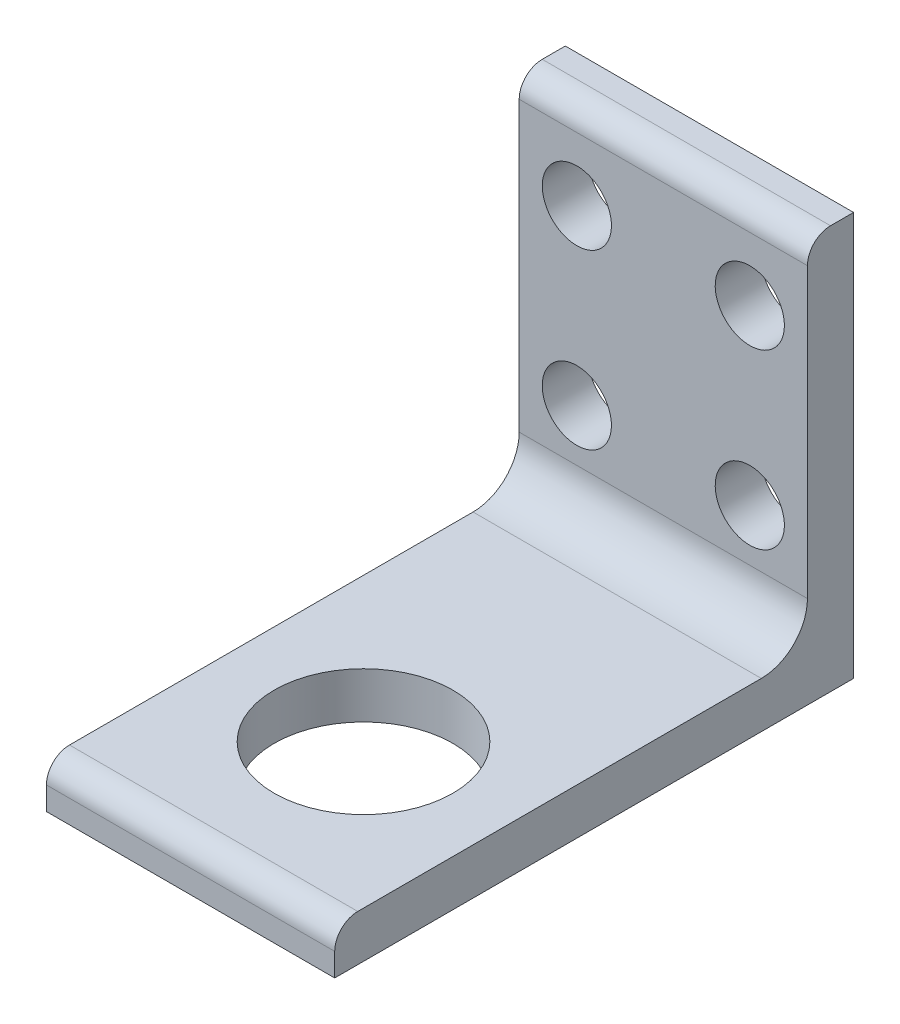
ISO-10303-21;
HEADER;
FILE_DESCRIPTION(('STEP AP214'),'2;1');
FILE_NAME('part.step','',(''),(''),'','','');
FILE_SCHEMA(('AUTOMOTIVE_DESIGN { 1 0 10303 214 1 1 1 1 }'));
ENDSEC;
DATA;
#1=APPLICATION_CONTEXT('core data for automotive mechanical design processes');
#2=APPLICATION_PROTOCOL_DEFINITION('international standard','automotive_design',2000,#1);
#3=PRODUCT_CONTEXT('',#1,'mechanical');
#4=PRODUCT('Part','Part','',(#3));
#5=PRODUCT_RELATED_PRODUCT_CATEGORY('part','',(#4));
#6=PRODUCT_DEFINITION_FORMATION('','',#4);
#7=PRODUCT_DEFINITION_CONTEXT('part definition',#1,'design');
#8=PRODUCT_DEFINITION('design','',#6,#7);
#9=PRODUCT_DEFINITION_SHAPE('','',#8);
#10=(LENGTH_UNIT() NAMED_UNIT(*) SI_UNIT(.MILLI.,.METRE.));
#11=(NAMED_UNIT(*) PLANE_ANGLE_UNIT() SI_UNIT($,.RADIAN.));
#12=(NAMED_UNIT(*) SI_UNIT($,.STERADIAN.) SOLID_ANGLE_UNIT());
#13=UNCERTAINTY_MEASURE_WITH_UNIT(LENGTH_MEASURE(1.E-05),#10,'distance_accuracy_value','');
#14=(GEOMETRIC_REPRESENTATION_CONTEXT(3) GLOBAL_UNCERTAINTY_ASSIGNED_CONTEXT((#13)) GLOBAL_UNIT_ASSIGNED_CONTEXT((#10,
#11,#12)) REPRESENTATION_CONTEXT('',''));
#15=CARTESIAN_POINT('',(0.,0.,0.));
#16=DIRECTION('',(0.,0.,1.));
#17=DIRECTION('',(1.,0.,0.));
#18=AXIS2_PLACEMENT_3D('',#15,#16,#17);
#19=CARTESIAN_POINT('',(25.,4.00000000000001,90.));
#20=DIRECTION('',(0.,0.,-1.));
#21=DIRECTION('',(-1.,0.,0.));
#22=AXIS2_PLACEMENT_3D('',#19,#20,#21);
#23=PLANE('',#22);
#24=DIRECTION('',(0.,-1.,0.));
#25=VECTOR('',#24,1.);
#26=CARTESIAN_POINT('',(-25.,4.00000000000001,90.));
#27=LINE('',#26,#25);
#28=CARTESIAN_POINT('',(-25.,4.00000000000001,90.));
#29=VERTEX_POINT('',#28);
#30=CARTESIAN_POINT('',(-25.,0.,90.));
#31=VERTEX_POINT('',#30);
#32=EDGE_CURVE('E190',#29,#31,#27,.T.);
#33=ORIENTED_EDGE('',*,*,#32,.T.);
#34=DIRECTION('',(-1.,0.,0.));
#35=VECTOR('',#34,1.);
#36=CARTESIAN_POINT('',(25.,0.,90.));
#37=LINE('',#36,#35);
#38=CARTESIAN_POINT('',(25.,0.,90.));
#39=VERTEX_POINT('',#38);
#40=EDGE_CURVE('E13',#39,#31,#37,.T.);
#41=ORIENTED_EDGE('',*,*,#40,.F.);
#42=DIRECTION('',(0.,-1.,0.));
#43=VECTOR('',#42,1.);
#44=CARTESIAN_POINT('',(25.,4.00000000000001,90.));
#45=LINE('',#44,#43);
#46=CARTESIAN_POINT('',(25.,4.00000000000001,90.));
#47=VERTEX_POINT('',#46);
#48=EDGE_CURVE('E216',#47,#39,#45,.T.);
#49=ORIENTED_EDGE('',*,*,#48,.F.);
#50=DIRECTION('',(-1.,0.,0.));
#51=VECTOR('',#50,1.);
#52=CARTESIAN_POINT('',(25.,4.00000000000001,90.));
#53=LINE('',#52,#51);
#54=EDGE_CURVE('E186',#47,#29,#53,.T.);
#55=ORIENTED_EDGE('',*,*,#54,.T.);
#56=EDGE_LOOP('',(#33,#41,#49,#55));
#57=FACE_BOUND('',#56,.T.);
#58=ADVANCED_FACE('F79',(#57),#23,.F.);
#59=CARTESIAN_POINT('',(25.,0.,90.));
#60=DIRECTION('',(0.,1.,0.));
#61=DIRECTION('',(0.,0.,1.));
#62=AXIS2_PLACEMENT_3D('',#59,#60,#61);
#63=PLANE('',#62);
#64=CARTESIAN_POINT('',(0.,0.,60.));
#65=DIRECTION('',(0.,1.,0.));
#66=DIRECTION('',(0.,0.,1.));
#67=AXIS2_PLACEMENT_3D('',#64,#65,#66);
#68=CIRCLE('',#67,15.5);
#69=CARTESIAN_POINT('',(0.,0.,75.5));
#70=VERTEX_POINT('',#69);
#71=EDGE_CURVE('E241',#70,#70,#68,.T.);
#72=ORIENTED_EDGE('',*,*,#71,.T.);
#73=EDGE_LOOP('',(#72));
#74=FACE_BOUND('',#73,.T.);
#75=DIRECTION('',(0.,0.,-1.));
#76=VECTOR('',#75,1.);
#77=CARTESIAN_POINT('',(-25.,0.,90.));
#78=LINE('',#77,#76);
#79=CARTESIAN_POINT('',(-25.,0.,0.));
#80=VERTEX_POINT('',#79);
#81=EDGE_CURVE('E194',#31,#80,#78,.T.);
#82=ORIENTED_EDGE('',*,*,#81,.T.);
#83=DIRECTION('',(-1.,0.,0.));
#84=VECTOR('',#83,1.);
#85=CARTESIAN_POINT('',(25.,0.,0.));
#86=LINE('',#85,#84);
#87=CARTESIAN_POINT('',(25.,0.,0.));
#88=VERTEX_POINT('',#87);
#89=EDGE_CURVE('E89',#88,#80,#86,.T.);
#90=ORIENTED_EDGE('',*,*,#89,.F.);
#91=DIRECTION('',(0.,0.,-1.));
#92=VECTOR('',#91,1.);
#93=CARTESIAN_POINT('',(25.,0.,90.));
#94=LINE('',#93,#92);
#95=EDGE_CURVE('E144',#39,#88,#94,.T.);
#96=ORIENTED_EDGE('',*,*,#95,.F.);
#97=ORIENTED_EDGE('',*,*,#40,.T.);
#98=EDGE_LOOP('',(#82,#90,#96,#97));
#99=FACE_BOUND('',#98,.T.);
#100=ADVANCED_FACE('F344',(#74,#99),#63,.F.);
#101=CARTESIAN_POINT('',(25.,0.,0.));
#102=DIRECTION('',(0.,0.,1.));
#103=DIRECTION('',(1.,0.,0.));
#104=AXIS2_PLACEMENT_3D('',#101,#102,#103);
#105=PLANE('',#104);
#106=CARTESIAN_POINT('',(-15.,25.,0.));
#107=DIRECTION('',(0.,0.,1.));
#108=DIRECTION('',(1.,0.,0.));
#109=AXIS2_PLACEMENT_3D('',#106,#107,#108);
#110=CIRCLE('',#109,6.00000000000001);
#111=CARTESIAN_POINT('',(-8.99999999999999,25.,0.));
#112=VERTEX_POINT('',#111);
#113=EDGE_CURVE('E499',#112,#112,#110,.T.);
#114=ORIENTED_EDGE('',*,*,#113,.T.);
#115=EDGE_LOOP('',(#114));
#116=FACE_BOUND('',#115,.T.);
#117=CARTESIAN_POINT('',(15.,25.,0.));
#118=DIRECTION('',(0.,0.,1.));
#119=DIRECTION('',(1.,0.,0.));
#120=AXIS2_PLACEMENT_3D('',#117,#118,#119);
#121=CIRCLE('',#120,6.);
#122=CARTESIAN_POINT('',(21.,25.,0.));
#123=VERTEX_POINT('',#122);
#124=EDGE_CURVE('E501',#123,#123,#121,.T.);
#125=ORIENTED_EDGE('',*,*,#124,.T.);
#126=EDGE_LOOP('',(#125));
#127=FACE_BOUND('',#126,.T.);
#128=CARTESIAN_POINT('',(15.,55.,0.));
#129=DIRECTION('',(0.,0.,1.));
#130=DIRECTION('',(1.,0.,0.));
#131=AXIS2_PLACEMENT_3D('',#128,#129,#130);
#132=CIRCLE('',#131,6.);
#133=CARTESIAN_POINT('',(21.,55.,0.));
#134=VERTEX_POINT('',#133);
#135=EDGE_CURVE('E505',#134,#134,#132,.T.);
#136=ORIENTED_EDGE('',*,*,#135,.T.);
#137=EDGE_LOOP('',(#136));
#138=FACE_BOUND('',#137,.T.);
#139=CARTESIAN_POINT('',(-15.,55.,0.));
#140=DIRECTION('',(0.,0.,1.));
#141=DIRECTION('',(1.,0.,0.));
#142=AXIS2_PLACEMENT_3D('',#139,#140,#141);
#143=CIRCLE('',#142,6.);
#144=CARTESIAN_POINT('',(-9.,55.,0.));
#145=VERTEX_POINT('',#144);
#146=EDGE_CURVE('E247',#145,#145,#143,.T.);
#147=ORIENTED_EDGE('',*,*,#146,.T.);
#148=EDGE_LOOP('',(#147));
#149=FACE_BOUND('',#148,.T.);
#150=DIRECTION('',(0.,1.,0.));
#151=VECTOR('',#150,1.);
#152=CARTESIAN_POINT('',(-25.,0.,0.));
#153=LINE('',#152,#151);
#154=CARTESIAN_POINT('',(-25.,70.,0.));
#155=VERTEX_POINT('',#154);
#156=EDGE_CURVE('E198',#80,#155,#153,.T.);
#157=ORIENTED_EDGE('',*,*,#156,.T.);
#158=DIRECTION('',(-1.,0.,0.));
#159=VECTOR('',#158,1.);
#160=CARTESIAN_POINT('',(25.,70.,0.));
#161=LINE('',#160,#159);
#162=CARTESIAN_POINT('',(25.,70.,0.));
#163=VERTEX_POINT('',#162);
#164=EDGE_CURVE('E231',#163,#155,#161,.T.);
#165=ORIENTED_EDGE('',*,*,#164,.F.);
#166=DIRECTION('',(0.,1.,0.));
#167=VECTOR('',#166,1.);
#168=CARTESIAN_POINT('',(25.,0.,0.));
#169=LINE('',#168,#167);
#170=EDGE_CURVE('E274',#88,#163,#169,.T.);
#171=ORIENTED_EDGE('',*,*,#170,.F.);
#172=ORIENTED_EDGE('',*,*,#89,.T.);
#173=EDGE_LOOP('',(#157,#165,#171,#172));
#174=FACE_BOUND('',#173,.T.);
#175=ADVANCED_FACE('F349',(#116,#127,#138,#149,#174),#105,.F.);
#176=CARTESIAN_POINT('',(25.,70.,0.));
#177=DIRECTION('',(0.,-1.,0.));
#178=DIRECTION('',(0.,0.,-1.));
#179=AXIS2_PLACEMENT_3D('',#176,#177,#178);
#180=PLANE('',#179);
#181=DIRECTION('',(0.,0.,1.));
#182=VECTOR('',#181,1.);
#183=CARTESIAN_POINT('',(-25.,70.,0.));
#184=LINE('',#183,#182);
#185=CARTESIAN_POINT('',(-25.,70.,4.00000000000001));
#186=VERTEX_POINT('',#185);
#187=EDGE_CURVE('E201',#155,#186,#184,.T.);
#188=ORIENTED_EDGE('',*,*,#187,.T.);
#189=DIRECTION('',(-1.,0.,0.));
#190=VECTOR('',#189,1.);
#191=CARTESIAN_POINT('',(25.,70.,4.00000000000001));
#192=LINE('',#191,#190);
#193=CARTESIAN_POINT('',(25.,70.,4.00000000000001));
#194=VERTEX_POINT('',#193);
#195=EDGE_CURVE('E227',#194,#186,#192,.T.);
#196=ORIENTED_EDGE('',*,*,#195,.F.);
#197=DIRECTION('',(0.,0.,1.));
#198=VECTOR('',#197,1.);
#199=CARTESIAN_POINT('',(25.,70.,0.));
#200=LINE('',#199,#198);
#201=EDGE_CURVE('E277',#163,#194,#200,.T.);
#202=ORIENTED_EDGE('',*,*,#201,.F.);
#203=ORIENTED_EDGE('',*,*,#164,.T.);
#204=EDGE_LOOP('',(#188,#196,#202,#203));
#205=FACE_BOUND('',#204,.T.);
#206=ADVANCED_FACE('F354',(#205),#180,.F.);
#207=CARTESIAN_POINT('',(25.,66.,4.00000000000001));
#208=DIRECTION('',(-1.,0.,0.));
#209=DIRECTION('',(0.,0.,1.));
#210=AXIS2_PLACEMENT_3D('',#207,#208,#209);
#211=CYLINDRICAL_SURFACE('',#210,4.);
#212=CARTESIAN_POINT('',(-25.,66.,4.00000000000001));
#213=DIRECTION('',(1.,0.,0.));
#214=DIRECTION('',(0.,0.,-1.));
#215=AXIS2_PLACEMENT_3D('',#212,#213,#214);
#216=CIRCLE('',#215,4.);
#217=CARTESIAN_POINT('',(-25.,66.,8.00000000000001));
#218=VERTEX_POINT('',#217);
#219=EDGE_CURVE('E204',#186,#218,#216,.T.);
#220=ORIENTED_EDGE('',*,*,#219,.T.);
#221=DIRECTION('',(-1.,0.,0.));
#222=VECTOR('',#221,1.);
#223=CARTESIAN_POINT('',(25.,66.,8.00000000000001));
#224=LINE('',#223,#222);
#225=CARTESIAN_POINT('',(25.,66.,8.00000000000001));
#226=VERTEX_POINT('',#225);
#227=EDGE_CURVE('E223',#226,#218,#224,.T.);
#228=ORIENTED_EDGE('',*,*,#227,.F.);
#229=CARTESIAN_POINT('',(25.,66.,4.00000000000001));
#230=DIRECTION('',(1.,0.,0.));
#231=DIRECTION('',(0.,0.,-1.));
#232=AXIS2_PLACEMENT_3D('',#229,#230,#231);
#233=CIRCLE('',#232,4.);
#234=EDGE_CURVE('E280',#194,#226,#233,.T.);
#235=ORIENTED_EDGE('',*,*,#234,.F.);
#236=ORIENTED_EDGE('',*,*,#195,.T.);
#237=EDGE_LOOP('',(#220,#228,#235,#236));
#238=FACE_BOUND('',#237,.T.);
#239=ADVANCED_FACE('F319',(#238),#211,.T.);
#240=CARTESIAN_POINT('',(25.,66.,8.00000000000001));
#241=DIRECTION('',(0.,0.,-1.));
#242=DIRECTION('',(0.,1.,0.));
#243=AXIS2_PLACEMENT_3D('',#240,#241,#242);
#244=PLANE('',#243);
#245=CARTESIAN_POINT('',(-15.,25.,8.));
#246=DIRECTION('',(0.,0.,-1.));
#247=DIRECTION('',(0.,1.,0.));
#248=AXIS2_PLACEMENT_3D('',#245,#246,#247);
#249=CIRCLE('',#248,6.00000000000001);
#250=CARTESIAN_POINT('',(-15.,31.,8.));
#251=VERTEX_POINT('',#250);
#252=EDGE_CURVE('E82',#251,#251,#249,.F.);
#253=ORIENTED_EDGE('',*,*,#252,.F.);
#254=EDGE_LOOP('',(#253));
#255=FACE_BOUND('',#254,.T.);
#256=CARTESIAN_POINT('',(15.,25.,8.));
#257=DIRECTION('',(0.,0.,-1.));
#258=DIRECTION('',(0.,1.,0.));
#259=AXIS2_PLACEMENT_3D('',#256,#257,#258);
#260=CIRCLE('',#259,6.);
#261=CARTESIAN_POINT('',(15.,31.,8.));
#262=VERTEX_POINT('',#261);
#263=EDGE_CURVE('E250',#262,#262,#260,.F.);
#264=ORIENTED_EDGE('',*,*,#263,.F.);
#265=EDGE_LOOP('',(#264));
#266=FACE_BOUND('',#265,.T.);
#267=CARTESIAN_POINT('',(15.,55.,8.00000000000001));
#268=DIRECTION('',(0.,0.,-1.));
#269=DIRECTION('',(0.,1.,0.));
#270=AXIS2_PLACEMENT_3D('',#267,#268,#269);
#271=CIRCLE('',#270,6.);
#272=CARTESIAN_POINT('',(15.,61.,8.00000000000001));
#273=VERTEX_POINT('',#272);
#274=EDGE_CURVE('E246',#273,#273,#271,.F.);
#275=ORIENTED_EDGE('',*,*,#274,.F.);
#276=EDGE_LOOP('',(#275));
#277=FACE_BOUND('',#276,.T.);
#278=CARTESIAN_POINT('',(-15.,55.,8.00000000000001));
#279=DIRECTION('',(0.,0.,-1.));
#280=DIRECTION('',(0.,1.,0.));
#281=AXIS2_PLACEMENT_3D('',#278,#279,#280);
#282=CIRCLE('',#281,6.);
#283=CARTESIAN_POINT('',(-15.,61.,8.00000000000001));
#284=VERTEX_POINT('',#283);
#285=EDGE_CURVE('E242',#284,#284,#282,.F.);
#286=ORIENTED_EDGE('',*,*,#285,.F.);
#287=EDGE_LOOP('',(#286));
#288=FACE_BOUND('',#287,.T.);
#289=DIRECTION('',(0.,-1.,0.));
#290=VECTOR('',#289,1.);
#291=CARTESIAN_POINT('',(-25.,66.,8.00000000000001));
#292=LINE('',#291,#290);
#293=CARTESIAN_POINT('',(-25.,16.,8.));
#294=VERTEX_POINT('',#293);
#295=EDGE_CURVE('E207',#218,#294,#292,.T.);
#296=ORIENTED_EDGE('',*,*,#295,.T.);
#297=DIRECTION('',(-1.,0.,0.));
#298=VECTOR('',#297,1.);
#299=CARTESIAN_POINT('',(25.,16.,8.));
#300=LINE('',#299,#298);
#301=CARTESIAN_POINT('',(25.,16.,8.));
#302=VERTEX_POINT('',#301);
#303=EDGE_CURVE('E178',#302,#294,#300,.T.);
#304=ORIENTED_EDGE('',*,*,#303,.F.);
#305=DIRECTION('',(0.,-1.,0.));
#306=VECTOR('',#305,1.);
#307=CARTESIAN_POINT('',(25.,66.,8.00000000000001));
#308=LINE('',#307,#306);
#309=EDGE_CURVE('E167',#226,#302,#308,.T.);
#310=ORIENTED_EDGE('',*,*,#309,.F.);
#311=ORIENTED_EDGE('',*,*,#227,.T.);
#312=EDGE_LOOP('',(#296,#304,#310,#311));
#313=FACE_BOUND('',#312,.T.);
#314=ADVANCED_FACE('F323',(#255,#266,#277,#288,#313),#244,.F.);
#315=CARTESIAN_POINT('',(25.,16.,16.));
#316=DIRECTION('',(-1.,0.,0.));
#317=DIRECTION('',(0.,0.,1.));
#318=AXIS2_PLACEMENT_3D('',#315,#316,#317);
#319=CYLINDRICAL_SURFACE('',#318,8.);
#320=CARTESIAN_POINT('',(-25.,16.,16.));
#321=DIRECTION('',(-1.,0.,0.));
#322=DIRECTION('',(0.,0.,1.));
#323=AXIS2_PLACEMENT_3D('',#320,#321,#322);
#324=CIRCLE('',#323,8.);
#325=CARTESIAN_POINT('',(-25.,8.,16.));
#326=VERTEX_POINT('',#325);
#327=EDGE_CURVE('E176',#294,#326,#324,.T.);
#328=ORIENTED_EDGE('',*,*,#327,.T.);
#329=DIRECTION('',(-1.,0.,0.));
#330=VECTOR('',#329,1.);
#331=CARTESIAN_POINT('',(25.,8.,16.));
#332=LINE('',#331,#330);
#333=CARTESIAN_POINT('',(25.,8.,16.));
#334=VERTEX_POINT('',#333);
#335=EDGE_CURVE('E173',#334,#326,#332,.T.);
#336=ORIENTED_EDGE('',*,*,#335,.F.);
#337=CARTESIAN_POINT('',(25.,16.,16.));
#338=DIRECTION('',(-1.,0.,0.));
#339=DIRECTION('',(0.,0.,1.));
#340=AXIS2_PLACEMENT_3D('',#337,#338,#339);
#341=CIRCLE('',#340,8.);
#342=EDGE_CURVE('E161',#302,#334,#341,.T.);
#343=ORIENTED_EDGE('',*,*,#342,.F.);
#344=ORIENTED_EDGE('',*,*,#303,.T.);
#345=EDGE_LOOP('',(#328,#336,#343,#344));
#346=FACE_BOUND('',#345,.T.);
#347=ADVANCED_FACE('F174',(#346),#319,.F.);
#348=CARTESIAN_POINT('',(25.,8.,16.));
#349=DIRECTION('',(0.,-1.,0.));
#350=DIRECTION('',(0.,0.,-1.));
#351=AXIS2_PLACEMENT_3D('',#348,#349,#350);
#352=PLANE('',#351);
#353=CARTESIAN_POINT('',(0.,8.,60.));
#354=DIRECTION('',(0.,-1.,0.));
#355=DIRECTION('',(0.,0.,-1.));
#356=AXIS2_PLACEMENT_3D('',#353,#354,#355);
#357=CIRCLE('',#356,15.5);
#358=CARTESIAN_POINT('',(0.,8.,44.5));
#359=VERTEX_POINT('',#358);
#360=EDGE_CURVE('E195',#359,#359,#357,.F.);
#361=ORIENTED_EDGE('',*,*,#360,.F.);
#362=EDGE_LOOP('',(#361));
#363=FACE_BOUND('',#362,.T.);
#364=DIRECTION('',(0.,0.,1.));
#365=VECTOR('',#364,1.);
#366=CARTESIAN_POINT('',(-25.,8.,16.));
#367=LINE('',#366,#365);
#368=CARTESIAN_POINT('',(-25.,8.00000000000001,86.));
#369=VERTEX_POINT('',#368);
#370=EDGE_CURVE('E130',#326,#369,#367,.T.);
#371=ORIENTED_EDGE('',*,*,#370,.T.);
#372=DIRECTION('',(-1.,0.,0.));
#373=VECTOR('',#372,1.);
#374=CARTESIAN_POINT('',(25.,8.00000000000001,86.));
#375=LINE('',#374,#373);
#376=CARTESIAN_POINT('',(25.,8.00000000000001,86.));
#377=VERTEX_POINT('',#376);
#378=EDGE_CURVE('E179',#377,#369,#375,.T.);
#379=ORIENTED_EDGE('',*,*,#378,.F.);
#380=DIRECTION('',(0.,0.,1.));
#381=VECTOR('',#380,1.);
#382=CARTESIAN_POINT('',(25.,8.,16.));
#383=LINE('',#382,#381);
#384=EDGE_CURVE('E165',#334,#377,#383,.T.);
#385=ORIENTED_EDGE('',*,*,#384,.F.);
#386=ORIENTED_EDGE('',*,*,#335,.T.);
#387=EDGE_LOOP('',(#371,#379,#385,#386));
#388=FACE_BOUND('',#387,.T.);
#389=ADVANCED_FACE('F181',(#363,#388),#352,.F.);
#390=CARTESIAN_POINT('',(25.,4.00000000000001,86.));
#391=DIRECTION('',(-1.,0.,0.));
#392=DIRECTION('',(0.,0.,1.));
#393=AXIS2_PLACEMENT_3D('',#390,#391,#392);
#394=CYLINDRICAL_SURFACE('',#393,4.);
#395=CARTESIAN_POINT('',(-25.,4.00000000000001,86.));
#396=DIRECTION('',(1.,0.,0.));
#397=DIRECTION('',(0.,0.,-1.));
#398=AXIS2_PLACEMENT_3D('',#395,#396,#397);
#399=CIRCLE('',#398,4.);
#400=EDGE_CURVE('E136',#369,#29,#399,.T.);
#401=ORIENTED_EDGE('',*,*,#400,.T.);
#402=ORIENTED_EDGE('',*,*,#54,.F.);
#403=CARTESIAN_POINT('',(25.,4.00000000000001,86.));
#404=DIRECTION('',(1.,0.,0.));
#405=DIRECTION('',(0.,0.,-1.));
#406=AXIS2_PLACEMENT_3D('',#403,#404,#405);
#407=CIRCLE('',#406,4.);
#408=EDGE_CURVE('E98',#377,#47,#407,.T.);
#409=ORIENTED_EDGE('',*,*,#408,.F.);
#410=ORIENTED_EDGE('',*,*,#378,.T.);
#411=EDGE_LOOP('',(#401,#402,#409,#410));
#412=FACE_BOUND('',#411,.T.);
#413=ADVANCED_FACE('F331',(#412),#394,.T.);
#414=CARTESIAN_POINT('',(25.,66.,4.00000000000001));
#415=DIRECTION('',(1.,0.,0.));
#416=DIRECTION('',(0.,0.,-1.));
#417=AXIS2_PLACEMENT_3D('',#414,#415,#416);
#418=PLANE('',#417);
#419=ORIENTED_EDGE('',*,*,#48,.T.);
#420=ORIENTED_EDGE('',*,*,#95,.T.);
#421=ORIENTED_EDGE('',*,*,#170,.T.);
#422=ORIENTED_EDGE('',*,*,#201,.T.);
#423=ORIENTED_EDGE('',*,*,#234,.T.);
#424=ORIENTED_EDGE('',*,*,#309,.T.);
#425=ORIENTED_EDGE('',*,*,#342,.T.);
#426=ORIENTED_EDGE('',*,*,#384,.T.);
#427=ORIENTED_EDGE('',*,*,#408,.T.);
#428=EDGE_LOOP('',(#419,#420,#421,#422,#423,#424,#425,#426,#427));
#429=FACE_BOUND('',#428,.T.);
#430=ADVANCED_FACE('F163',(#429),#418,.T.);
#431=CARTESIAN_POINT('',(-25.,66.,4.00000000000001));
#432=DIRECTION('',(1.,0.,0.));
#433=DIRECTION('',(0.,0.,-1.));
#434=AXIS2_PLACEMENT_3D('',#431,#432,#433);
#435=PLANE('',#434);
#436=ORIENTED_EDGE('',*,*,#32,.F.);
#437=ORIENTED_EDGE('',*,*,#400,.F.);
#438=ORIENTED_EDGE('',*,*,#370,.F.);
#439=ORIENTED_EDGE('',*,*,#327,.F.);
#440=ORIENTED_EDGE('',*,*,#295,.F.);
#441=ORIENTED_EDGE('',*,*,#219,.F.);
#442=ORIENTED_EDGE('',*,*,#187,.F.);
#443=ORIENTED_EDGE('',*,*,#156,.F.);
#444=ORIENTED_EDGE('',*,*,#81,.F.);
#445=EDGE_LOOP('',(#436,#437,#438,#439,#440,#441,#442,#443,#444));
#446=FACE_BOUND('',#445,.T.);
#447=ADVANCED_FACE('F326',(#446),#435,.F.);
#448=CARTESIAN_POINT('',(0.,10.,60.));
#449=DIRECTION('',(0.,-1.,0.));
#450=DIRECTION('',(0.,0.,-1.));
#451=AXIS2_PLACEMENT_3D('',#448,#449,#450);
#452=CYLINDRICAL_SURFACE('',#451,15.5);
#453=ORIENTED_EDGE('',*,*,#71,.F.);
#454=EDGE_LOOP('',(#453));
#455=FACE_BOUND('',#454,.T.);
#456=ORIENTED_EDGE('',*,*,#360,.T.);
#457=EDGE_LOOP('',(#456));
#458=FACE_BOUND('',#457,.T.);
#459=ADVANCED_FACE('F413',(#455,#458),#452,.F.);
#460=CARTESIAN_POINT('',(-15.,55.,10.));
#461=DIRECTION('',(0.,0.,-1.));
#462=DIRECTION('',(-1.,0.,0.));
#463=AXIS2_PLACEMENT_3D('',#460,#461,#462);
#464=CYLINDRICAL_SURFACE('',#463,6.);
#465=ORIENTED_EDGE('',*,*,#146,.F.);
#466=EDGE_LOOP('',(#465));
#467=FACE_BOUND('',#466,.T.);
#468=ORIENTED_EDGE('',*,*,#285,.T.);
#469=EDGE_LOOP('',(#468));
#470=FACE_BOUND('',#469,.T.);
#471=ADVANCED_FACE('F422',(#467,#470),#464,.F.);
#472=CARTESIAN_POINT('',(15.,55.,10.));
#473=DIRECTION('',(0.,0.,-1.));
#474=DIRECTION('',(-1.,0.,0.));
#475=AXIS2_PLACEMENT_3D('',#472,#473,#474);
#476=CYLINDRICAL_SURFACE('',#475,6.);
#477=ORIENTED_EDGE('',*,*,#135,.F.);
#478=EDGE_LOOP('',(#477));
#479=FACE_BOUND('',#478,.T.);
#480=ORIENTED_EDGE('',*,*,#274,.T.);
#481=EDGE_LOOP('',(#480));
#482=FACE_BOUND('',#481,.T.);
#483=ADVANCED_FACE('F431',(#479,#482),#476,.F.);
#484=CARTESIAN_POINT('',(15.,25.,10.));
#485=DIRECTION('',(0.,0.,-1.));
#486=DIRECTION('',(-1.,0.,0.));
#487=AXIS2_PLACEMENT_3D('',#484,#485,#486);
#488=CYLINDRICAL_SURFACE('',#487,6.);
#489=ORIENTED_EDGE('',*,*,#124,.F.);
#490=EDGE_LOOP('',(#489));
#491=FACE_BOUND('',#490,.T.);
#492=ORIENTED_EDGE('',*,*,#263,.T.);
#493=EDGE_LOOP('',(#492));
#494=FACE_BOUND('',#493,.T.);
#495=ADVANCED_FACE('F440',(#491,#494),#488,.F.);
#496=CARTESIAN_POINT('',(-15.,25.,10.));
#497=DIRECTION('',(0.,0.,-1.));
#498=DIRECTION('',(-1.,0.,0.));
#499=AXIS2_PLACEMENT_3D('',#496,#497,#498);
#500=CYLINDRICAL_SURFACE('',#499,6.00000000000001);
#501=ORIENTED_EDGE('',*,*,#113,.F.);
#502=EDGE_LOOP('',(#501));
#503=FACE_BOUND('',#502,.T.);
#504=ORIENTED_EDGE('',*,*,#252,.T.);
#505=EDGE_LOOP('',(#504));
#506=FACE_BOUND('',#505,.T.);
#507=ADVANCED_FACE('F449',(#503,#506),#500,.F.);
#508=CLOSED_SHELL('',(#58,#100,#175,#206,#239,#314,#347,#389,#413,#430,#447,#459,#471,#483,#495,#507));
#509=MANIFOLD_SOLID_BREP('B2',#508);
#510=ADVANCED_BREP_SHAPE_REPRESENTATION('',(#18,#509),#14);
#511=SHAPE_DEFINITION_REPRESENTATION(#9,#510);
ENDSEC;
END-ISO-10303-21;
